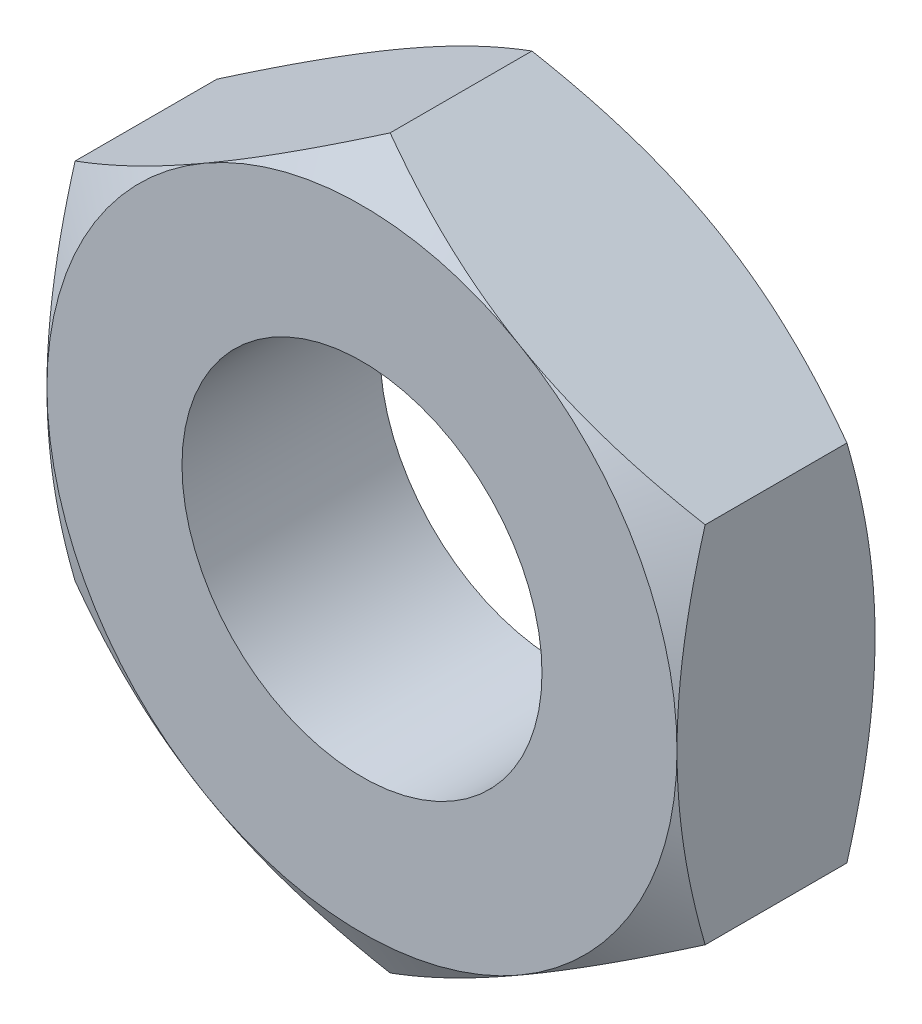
from build123d import *

# Parameters (mm, degrees)
BASE_EXTRUSION_DEPTH    = 2.2
ESQUISSE3_R             = 2
ENL_V_MAT_EXTRU_1_DEPTH = 2.2


with BuildPart() as part:
    # Esquisse1 → Base-Extrusion (new body)
    with BuildSketch(Plane.XY):
        Polygon((3.5, -2.020725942), (3.5, 2.020725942), (0, 4.041451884), (-3.5, 2.020725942), (-3.5, -2.020725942), (0, -4.041451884), align=None)
    extrude(amount=-BASE_EXTRUSION_DEPTH)

    # Esquisse2 → Enl_vement de mati_re-R_volution1 (revolve, cut)
    with BuildSketch(Plane(origin=(0, 0, 0), x_dir=(1, 0, 0), z_dir=(0, 1, 0))):
        Polygon((-3.5, 0), (-6.405255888, 0), (-6.405255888, 2.2), (-3.5, 2.2), (-5.405255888, 1.1), align=None)
    revolve(axis=Axis((0, 0, -2.2), (0, 0, 1)), mode=Mode.SUBTRACT)

    # Esquisse3 → Enl_v. mat.-Extru.1 (cut)
    with BuildSketch(Plane.XY):
        Circle(ESQUISSE3_R)
    extrude(amount=-ENL_V_MAT_EXTRU_1_DEPTH, mode=Mode.SUBTRACT)


solid = part.part
